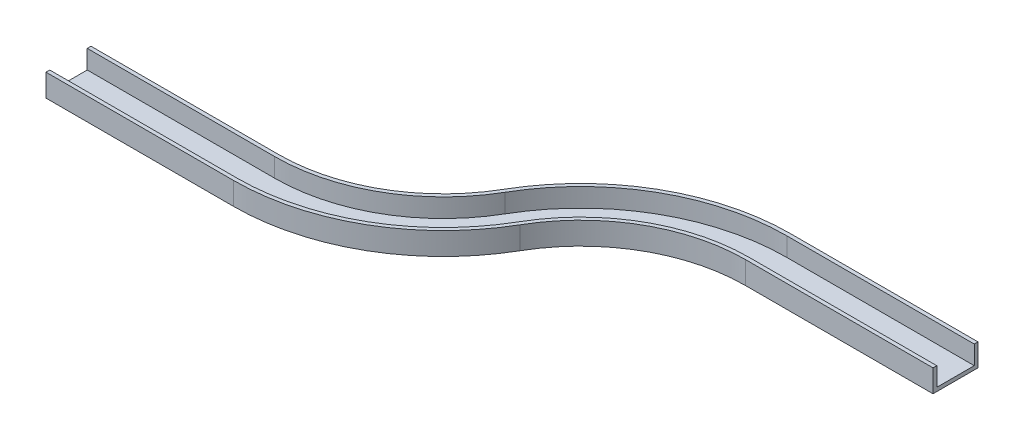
ISO-10303-21;
HEADER;
FILE_DESCRIPTION(('STEP AP214'),'2;1');
FILE_NAME('part.step','',(''),(''),'','','');
FILE_SCHEMA(('AUTOMOTIVE_DESIGN { 1 0 10303 214 1 1 1 1 }'));
ENDSEC;
DATA;
#1=APPLICATION_CONTEXT('core data for automotive mechanical design processes');
#2=APPLICATION_PROTOCOL_DEFINITION('international standard','automotive_design',2000,#1);
#3=PRODUCT_CONTEXT('',#1,'mechanical');
#4=PRODUCT('Part','Part','',(#3));
#5=PRODUCT_RELATED_PRODUCT_CATEGORY('part','',(#4));
#6=PRODUCT_DEFINITION_FORMATION('','',#4);
#7=PRODUCT_DEFINITION_CONTEXT('part definition',#1,'design');
#8=PRODUCT_DEFINITION('design','',#6,#7);
#9=PRODUCT_DEFINITION_SHAPE('','',#8);
#10=(LENGTH_UNIT() NAMED_UNIT(*) SI_UNIT(.MILLI.,.METRE.));
#11=(NAMED_UNIT(*) PLANE_ANGLE_UNIT() SI_UNIT($,.RADIAN.));
#12=(NAMED_UNIT(*) SI_UNIT($,.STERADIAN.) SOLID_ANGLE_UNIT());
#13=UNCERTAINTY_MEASURE_WITH_UNIT(LENGTH_MEASURE(1.E-05),#10,'distance_accuracy_value','');
#14=(GEOMETRIC_REPRESENTATION_CONTEXT(3) GLOBAL_UNCERTAINTY_ASSIGNED_CONTEXT((#13)) GLOBAL_UNIT_ASSIGNED_CONTEXT((#10,
#11,#12)) REPRESENTATION_CONTEXT('',''));
#15=CARTESIAN_POINT('',(0.,0.,0.));
#16=DIRECTION('',(0.,0.,1.));
#17=DIRECTION('',(1.,0.,0.));
#18=AXIS2_PLACEMENT_3D('',#15,#16,#17);
#19=CARTESIAN_POINT('',(1.11022302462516E-13,50.,49.9999999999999));
#20=DIRECTION('',(0.,0.,1.));
#21=DIRECTION('',(1.,0.,0.));
#22=AXIS2_PLACEMENT_3D('',#19,#20,#21);
#23=PLANE('',#22);
#24=DIRECTION('',(0.,1.,0.));
#25=VECTOR('',#24,1.);
#26=CARTESIAN_POINT('',(1.11022302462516E-13,50.,49.9999999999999));
#27=LINE('',#26,#25);
#28=CARTESIAN_POINT('',(1.11022302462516E-13,0.,49.9999999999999));
#29=VERTEX_POINT('',#28);
#30=CARTESIAN_POINT('',(1.11022302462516E-13,50.,49.9999999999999));
#31=VERTEX_POINT('',#30);
#32=EDGE_CURVE('E279',#29,#31,#27,.T.);
#33=ORIENTED_EDGE('',*,*,#32,.F.);
#34=DIRECTION('',(-1.,0.,0.));
#35=VECTOR('',#34,1.);
#36=CARTESIAN_POINT('',(1.11022302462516E-13,0.,49.9999999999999));
#37=LINE('',#36,#35);
#38=CARTESIAN_POINT('',(-500.,0.,50.));
#39=VERTEX_POINT('',#38);
#40=EDGE_CURVE('E40',#29,#39,#37,.T.);
#41=ORIENTED_EDGE('',*,*,#40,.T.);
#42=DIRECTION('',(0.,1.,0.));
#43=VECTOR('',#42,1.);
#44=CARTESIAN_POINT('',(-500.,50.,50.));
#45=LINE('',#44,#43);
#46=CARTESIAN_POINT('',(-500.,50.,50.));
#47=VERTEX_POINT('',#46);
#48=EDGE_CURVE('E47',#39,#47,#45,.T.);
#49=ORIENTED_EDGE('',*,*,#48,.T.);
#50=DIRECTION('',(-1.,0.,0.));
#51=VECTOR('',#50,1.);
#52=CARTESIAN_POINT('',(1.11022302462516E-13,50.,49.9999999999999));
#53=LINE('',#52,#51);
#54=EDGE_CURVE('E11',#31,#47,#53,.T.);
#55=ORIENTED_EDGE('',*,*,#54,.F.);
#56=EDGE_LOOP('',(#33,#41,#49,#55));
#57=FACE_BOUND('',#56,.T.);
#58=ADVANCED_FACE('F33',(#57),#23,.F.);
#59=CARTESIAN_POINT('',(2.77555756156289E-13,50.,-50.0000000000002));
#60=DIRECTION('',(0.,0.,-1.));
#61=DIRECTION('',(-1.,0.,0.));
#62=AXIS2_PLACEMENT_3D('',#59,#60,#61);
#63=PLANE('',#62);
#64=DIRECTION('',(0.,-1.,0.));
#65=VECTOR('',#64,1.);
#66=CARTESIAN_POINT('',(2.77555756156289E-13,50.,-50.0000000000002));
#67=LINE('',#66,#65);
#68=CARTESIAN_POINT('',(2.77555756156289E-13,50.,-50.0000000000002));
#69=VERTEX_POINT('',#68);
#70=CARTESIAN_POINT('',(2.77555756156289E-13,0.,-50.0000000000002));
#71=VERTEX_POINT('',#70);
#72=EDGE_CURVE('E276',#69,#71,#67,.T.);
#73=ORIENTED_EDGE('',*,*,#72,.F.);
#74=DIRECTION('',(-1.,0.,0.));
#75=VECTOR('',#74,1.);
#76=CARTESIAN_POINT('',(2.77555756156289E-13,50.,-50.0000000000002));
#77=LINE('',#76,#75);
#78=CARTESIAN_POINT('',(-500.,50.,-50.0000000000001));
#79=VERTEX_POINT('',#78);
#80=EDGE_CURVE('E332',#69,#79,#77,.T.);
#81=ORIENTED_EDGE('',*,*,#80,.T.);
#82=DIRECTION('',(0.,-1.,0.));
#83=VECTOR('',#82,1.);
#84=CARTESIAN_POINT('',(-500.,50.,-50.0000000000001));
#85=LINE('',#84,#83);
#86=CARTESIAN_POINT('',(-500.,0.,-50.0000000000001));
#87=VERTEX_POINT('',#86);
#88=EDGE_CURVE('E316',#79,#87,#85,.T.);
#89=ORIENTED_EDGE('',*,*,#88,.T.);
#90=DIRECTION('',(-1.,0.,0.));
#91=VECTOR('',#90,1.);
#92=CARTESIAN_POINT('',(2.77555756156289E-13,0.,-50.0000000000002));
#93=LINE('',#92,#91);
#94=EDGE_CURVE('E335',#71,#87,#93,.T.);
#95=ORIENTED_EDGE('',*,*,#94,.F.);
#96=EDGE_LOOP('',(#73,#81,#89,#95));
#97=FACE_BOUND('',#96,.T.);
#98=ADVANCED_FACE('F362',(#97),#63,.F.);
#99=CARTESIAN_POINT('',(1.66533453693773E-13,50.,-60.0000000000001));
#100=DIRECTION('',(0.,0.,1.));
#101=DIRECTION('',(1.,0.,0.));
#102=AXIS2_PLACEMENT_3D('',#99,#100,#101);
#103=PLANE('',#102);
#104=DIRECTION('',(0.,1.,0.));
#105=VECTOR('',#104,1.);
#106=CARTESIAN_POINT('',(1.66533453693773E-13,50.,-60.0000000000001));
#107=LINE('',#106,#105);
#108=CARTESIAN_POINT('',(1.66533453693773E-13,-10.,-60.0000000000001));
#109=VERTEX_POINT('',#108);
#110=CARTESIAN_POINT('',(1.66533453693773E-13,50.,-60.0000000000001));
#111=VERTEX_POINT('',#110);
#112=EDGE_CURVE('E273',#109,#111,#107,.T.);
#113=ORIENTED_EDGE('',*,*,#112,.F.);
#114=DIRECTION('',(-1.,0.,0.));
#115=VECTOR('',#114,1.);
#116=CARTESIAN_POINT('',(1.66533453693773E-13,-10.,-60.0000000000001));
#117=LINE('',#116,#115);
#118=CARTESIAN_POINT('',(-500.,-10.,-60.));
#119=VERTEX_POINT('',#118);
#120=EDGE_CURVE('E326',#109,#119,#117,.T.);
#121=ORIENTED_EDGE('',*,*,#120,.T.);
#122=DIRECTION('',(0.,1.,0.));
#123=VECTOR('',#122,1.);
#124=CARTESIAN_POINT('',(-500.,50.,-60.));
#125=LINE('',#124,#123);
#126=CARTESIAN_POINT('',(-500.,50.,-60.));
#127=VERTEX_POINT('',#126);
#128=EDGE_CURVE('E312',#119,#127,#125,.T.);
#129=ORIENTED_EDGE('',*,*,#128,.T.);
#130=DIRECTION('',(-1.,0.,0.));
#131=VECTOR('',#130,1.);
#132=CARTESIAN_POINT('',(1.66533453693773E-13,50.,-60.0000000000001));
#133=LINE('',#132,#131);
#134=EDGE_CURVE('E329',#111,#127,#133,.T.);
#135=ORIENTED_EDGE('',*,*,#134,.F.);
#136=EDGE_LOOP('',(#113,#121,#129,#135));
#137=FACE_BOUND('',#136,.T.);
#138=ADVANCED_FACE('F390',(#137),#103,.F.);
#139=CARTESIAN_POINT('',(0.,50.,59.9999999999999));
#140=DIRECTION('',(0.,0.,-1.));
#141=DIRECTION('',(-1.,0.,0.));
#142=AXIS2_PLACEMENT_3D('',#139,#140,#141);
#143=PLANE('',#142);
#144=DIRECTION('',(0.,-1.,0.));
#145=VECTOR('',#144,1.);
#146=CARTESIAN_POINT('',(0.,50.,59.9999999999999));
#147=LINE('',#146,#145);
#148=CARTESIAN_POINT('',(0.,50.,59.9999999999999));
#149=VERTEX_POINT('',#148);
#150=CARTESIAN_POINT('',(0.,-10.,59.9999999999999));
#151=VERTEX_POINT('',#150);
#152=EDGE_CURVE('E270',#149,#151,#147,.T.);
#153=ORIENTED_EDGE('',*,*,#152,.F.);
#154=DIRECTION('',(-1.,0.,0.));
#155=VECTOR('',#154,1.);
#156=CARTESIAN_POINT('',(0.,50.,59.9999999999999));
#157=LINE('',#156,#155);
#158=CARTESIAN_POINT('',(-500.,50.,60.));
#159=VERTEX_POINT('',#158);
#160=EDGE_CURVE('E320',#149,#159,#157,.T.);
#161=ORIENTED_EDGE('',*,*,#160,.T.);
#162=DIRECTION('',(0.,-1.,0.));
#163=VECTOR('',#162,1.);
#164=CARTESIAN_POINT('',(-500.,50.,60.));
#165=LINE('',#164,#163);
#166=CARTESIAN_POINT('',(-500.,-10.,60.));
#167=VERTEX_POINT('',#166);
#168=EDGE_CURVE('E308',#159,#167,#165,.T.);
#169=ORIENTED_EDGE('',*,*,#168,.T.);
#170=DIRECTION('',(-1.,0.,0.));
#171=VECTOR('',#170,1.);
#172=CARTESIAN_POINT('',(0.,-10.,59.9999999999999));
#173=LINE('',#172,#171);
#174=EDGE_CURVE('E323',#151,#167,#173,.T.);
#175=ORIENTED_EDGE('',*,*,#174,.F.);
#176=EDGE_LOOP('',(#153,#161,#169,#175));
#177=FACE_BOUND('',#176,.T.);
#178=ADVANCED_FACE('F372',(#177),#143,.F.);
#179=CARTESIAN_POINT('',(0.,0.,-500.));
#180=DIRECTION('',(0.,-1.,0.));
#181=DIRECTION('',(0.,0.,-1.));
#182=AXIS2_PLACEMENT_3D('',#179,#180,#181);
#183=CYLINDRICAL_SURFACE('',#182,550.);
#184=DIRECTION('',(0.,1.,0.));
#185=VECTOR('',#184,1.);
#186=CARTESIAN_POINT('',(476.313972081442,50.,-225.000000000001));
#187=LINE('',#186,#185);
#188=CARTESIAN_POINT('',(476.313972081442,0.,-225.000000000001));
#189=VERTEX_POINT('',#188);
#190=CARTESIAN_POINT('',(476.313972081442,50.,-225.000000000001));
#191=VERTEX_POINT('',#190);
#192=EDGE_CURVE('E245',#189,#191,#187,.T.);
#193=ORIENTED_EDGE('',*,*,#192,.F.);
#194=CARTESIAN_POINT('',(0.,0.,-500.));
#195=DIRECTION('',(0.,-1.,0.));
#196=DIRECTION('',(0.,0.,-1.));
#197=AXIS2_PLACEMENT_3D('',#194,#195,#196);
#198=CIRCLE('',#197,550.);
#199=EDGE_CURVE('E300',#189,#29,#198,.T.);
#200=ORIENTED_EDGE('',*,*,#199,.T.);
#201=ORIENTED_EDGE('',*,*,#32,.T.);
#202=CARTESIAN_POINT('',(0.,50.,-500.));
#203=DIRECTION('',(0.,-1.,0.));
#204=DIRECTION('',(0.,0.,-1.));
#205=AXIS2_PLACEMENT_3D('',#202,#203,#204);
#206=CIRCLE('',#205,550.);
#207=EDGE_CURVE('E303',#191,#31,#206,.T.);
#208=ORIENTED_EDGE('',*,*,#207,.F.);
#209=EDGE_LOOP('',(#193,#200,#201,#208));
#210=FACE_BOUND('',#209,.T.);
#211=ADVANCED_FACE('F342',(#210),#183,.F.);
#212=CARTESIAN_POINT('',(0.,0.,-500.));
#213=DIRECTION('',(0.,-1.,0.));
#214=DIRECTION('',(0.,0.,-1.));
#215=AXIS2_PLACEMENT_3D('',#212,#213,#214);
#216=CYLINDRICAL_SURFACE('',#215,450.);
#217=DIRECTION('',(0.,-1.,0.));
#218=VECTOR('',#217,1.);
#219=CARTESIAN_POINT('',(389.711431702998,50.,-275.000000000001));
#220=LINE('',#219,#218);
#221=CARTESIAN_POINT('',(389.711431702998,50.,-275.000000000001));
#222=VERTEX_POINT('',#221);
#223=CARTESIAN_POINT('',(389.711431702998,0.,-275.000000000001));
#224=VERTEX_POINT('',#223);
#225=EDGE_CURVE('E242',#222,#224,#220,.T.);
#226=ORIENTED_EDGE('',*,*,#225,.F.);
#227=CARTESIAN_POINT('',(0.,50.,-500.));
#228=DIRECTION('',(0.,-1.,0.));
#229=DIRECTION('',(0.,0.,-1.));
#230=AXIS2_PLACEMENT_3D('',#227,#228,#229);
#231=CIRCLE('',#230,450.);
#232=EDGE_CURVE('E294',#222,#69,#231,.T.);
#233=ORIENTED_EDGE('',*,*,#232,.T.);
#234=ORIENTED_EDGE('',*,*,#72,.T.);
#235=CARTESIAN_POINT('',(0.,0.,-500.));
#236=DIRECTION('',(0.,-1.,0.));
#237=DIRECTION('',(0.,0.,-1.));
#238=AXIS2_PLACEMENT_3D('',#235,#236,#237);
#239=CIRCLE('',#238,450.);
#240=EDGE_CURVE('E297',#224,#71,#239,.T.);
#241=ORIENTED_EDGE('',*,*,#240,.F.);
#242=EDGE_LOOP('',(#226,#233,#234,#241));
#243=FACE_BOUND('',#242,.T.);
#244=ADVANCED_FACE('F359',(#243),#216,.T.);
#245=CARTESIAN_POINT('',(0.,0.,-500.));
#246=DIRECTION('',(0.,-1.,0.));
#247=DIRECTION('',(0.,0.,-1.));
#248=AXIS2_PLACEMENT_3D('',#245,#246,#247);
#249=CYLINDRICAL_SURFACE('',#248,440.);
#250=DIRECTION('',(0.,1.,0.));
#251=VECTOR('',#250,1.);
#252=CARTESIAN_POINT('',(381.051177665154,50.,-280.000000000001));
#253=LINE('',#252,#251);
#254=CARTESIAN_POINT('',(381.051177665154,-10.,-280.000000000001));
#255=VERTEX_POINT('',#254);
#256=CARTESIAN_POINT('',(381.051177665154,50.,-280.000000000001));
#257=VERTEX_POINT('',#256);
#258=EDGE_CURVE('E239',#255,#257,#253,.T.);
#259=ORIENTED_EDGE('',*,*,#258,.F.);
#260=CARTESIAN_POINT('',(0.,-10.,-500.));
#261=DIRECTION('',(0.,-1.,0.));
#262=DIRECTION('',(0.,0.,-1.));
#263=AXIS2_PLACEMENT_3D('',#260,#261,#262);
#264=CIRCLE('',#263,440.);
#265=EDGE_CURVE('E288',#255,#109,#264,.T.);
#266=ORIENTED_EDGE('',*,*,#265,.T.);
#267=ORIENTED_EDGE('',*,*,#112,.T.);
#268=CARTESIAN_POINT('',(0.,50.,-500.));
#269=DIRECTION('',(0.,-1.,0.));
#270=DIRECTION('',(0.,0.,-1.));
#271=AXIS2_PLACEMENT_3D('',#268,#269,#270);
#272=CIRCLE('',#271,440.);
#273=EDGE_CURVE('E291',#257,#111,#272,.T.);
#274=ORIENTED_EDGE('',*,*,#273,.F.);
#275=EDGE_LOOP('',(#259,#266,#267,#274));
#276=FACE_BOUND('',#275,.T.);
#277=ADVANCED_FACE('F393',(#276),#249,.F.);
#278=CARTESIAN_POINT('',(0.,0.,-500.));
#279=DIRECTION('',(0.,-1.,0.));
#280=DIRECTION('',(0.,0.,-1.));
#281=AXIS2_PLACEMENT_3D('',#278,#279,#280);
#282=CYLINDRICAL_SURFACE('',#281,560.);
#283=DIRECTION('',(0.,-1.,0.));
#284=VECTOR('',#283,1.);
#285=CARTESIAN_POINT('',(484.974226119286,50.,-220.000000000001));
#286=LINE('',#285,#284);
#287=CARTESIAN_POINT('',(484.974226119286,50.,-220.000000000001));
#288=VERTEX_POINT('',#287);
#289=CARTESIAN_POINT('',(484.974226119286,-10.,-220.000000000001));
#290=VERTEX_POINT('',#289);
#291=EDGE_CURVE('E225',#288,#290,#286,.T.);
#292=ORIENTED_EDGE('',*,*,#291,.F.);
#293=CARTESIAN_POINT('',(0.,50.,-500.));
#294=DIRECTION('',(0.,-1.,0.));
#295=DIRECTION('',(0.,0.,-1.));
#296=AXIS2_PLACEMENT_3D('',#293,#294,#295);
#297=CIRCLE('',#296,560.);
#298=EDGE_CURVE('E282',#288,#149,#297,.T.);
#299=ORIENTED_EDGE('',*,*,#298,.T.);
#300=ORIENTED_EDGE('',*,*,#152,.T.);
#301=CARTESIAN_POINT('',(0.,-10.,-500.));
#302=DIRECTION('',(0.,-1.,0.));
#303=DIRECTION('',(0.,0.,-1.));
#304=AXIS2_PLACEMENT_3D('',#301,#302,#303);
#305=CIRCLE('',#304,560.);
#306=EDGE_CURVE('E285',#290,#151,#305,.T.);
#307=ORIENTED_EDGE('',*,*,#306,.F.);
#308=EDGE_LOOP('',(#292,#299,#300,#307));
#309=FACE_BOUND('',#308,.T.);
#310=ADVANCED_FACE('F374',(#309),#282,.T.);
#311=CARTESIAN_POINT('',(866.02540378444,0.,-2.42683658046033E-12));
#312=DIRECTION('',(0.,1.,0.));
#313=DIRECTION('',(0.,0.,1.));
#314=AXIS2_PLACEMENT_3D('',#311,#312,#313);
#315=CYLINDRICAL_SURFACE('',#314,450.);
#316=DIRECTION('',(0.,1.,0.));
#317=VECTOR('',#316,1.);
#318=CARTESIAN_POINT('',(866.02540378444,50.,-450.000000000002));
#319=LINE('',#318,#317);
#320=CARTESIAN_POINT('',(866.02540378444,0.,-450.000000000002));
#321=VERTEX_POINT('',#320);
#322=CARTESIAN_POINT('',(866.02540378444,50.,-450.000000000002));
#323=VERTEX_POINT('',#322);
#324=EDGE_CURVE('E183',#321,#323,#319,.T.);
#325=ORIENTED_EDGE('',*,*,#324,.F.);
#326=CARTESIAN_POINT('',(866.02540378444,0.,-2.42683658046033E-12));
#327=DIRECTION('',(0.,1.,0.));
#328=DIRECTION('',(0.,0.,1.));
#329=AXIS2_PLACEMENT_3D('',#326,#327,#328);
#330=CIRCLE('',#329,450.);
#331=EDGE_CURVE('E264',#321,#189,#330,.T.);
#332=ORIENTED_EDGE('',*,*,#331,.T.);
#333=ORIENTED_EDGE('',*,*,#192,.T.);
#334=CARTESIAN_POINT('',(866.02540378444,50.,-2.42683658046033E-12));
#335=DIRECTION('',(0.,1.,0.));
#336=DIRECTION('',(0.,0.,1.));
#337=AXIS2_PLACEMENT_3D('',#334,#335,#336);
#338=CIRCLE('',#337,450.);
#339=EDGE_CURVE('E267',#323,#191,#338,.T.);
#340=ORIENTED_EDGE('',*,*,#339,.F.);
#341=EDGE_LOOP('',(#325,#332,#333,#340));
#342=FACE_BOUND('',#341,.T.);
#343=ADVANCED_FACE('F344',(#342),#315,.T.);
#344=CARTESIAN_POINT('',(866.02540378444,0.,-2.42683658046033E-12));
#345=DIRECTION('',(0.,1.,0.));
#346=DIRECTION('',(0.,0.,1.));
#347=AXIS2_PLACEMENT_3D('',#344,#345,#346);
#348=CYLINDRICAL_SURFACE('',#347,550.);
#349=DIRECTION('',(0.,-1.,0.));
#350=VECTOR('',#349,1.);
#351=CARTESIAN_POINT('',(866.02540378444,50.,-550.000000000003));
#352=LINE('',#351,#350);
#353=CARTESIAN_POINT('',(866.02540378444,50.,-550.000000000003));
#354=VERTEX_POINT('',#353);
#355=CARTESIAN_POINT('',(866.02540378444,0.,-550.000000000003));
#356=VERTEX_POINT('',#355);
#357=EDGE_CURVE('E218',#354,#356,#352,.T.);
#358=ORIENTED_EDGE('',*,*,#357,.F.);
#359=CARTESIAN_POINT('',(866.02540378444,50.,-2.42683658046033E-12));
#360=DIRECTION('',(0.,1.,0.));
#361=DIRECTION('',(0.,0.,1.));
#362=AXIS2_PLACEMENT_3D('',#359,#360,#361);
#363=CIRCLE('',#362,550.);
#364=EDGE_CURVE('E258',#354,#222,#363,.T.);
#365=ORIENTED_EDGE('',*,*,#364,.T.);
#366=ORIENTED_EDGE('',*,*,#225,.T.);
#367=CARTESIAN_POINT('',(866.02540378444,0.,-2.42683658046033E-12));
#368=DIRECTION('',(0.,1.,0.));
#369=DIRECTION('',(0.,0.,1.));
#370=AXIS2_PLACEMENT_3D('',#367,#368,#369);
#371=CIRCLE('',#370,550.);
#372=EDGE_CURVE('E261',#356,#224,#371,.T.);
#373=ORIENTED_EDGE('',*,*,#372,.F.);
#374=EDGE_LOOP('',(#358,#365,#366,#373));
#375=FACE_BOUND('',#374,.T.);
#376=ADVANCED_FACE('F356',(#375),#348,.F.);
#377=CARTESIAN_POINT('',(866.02540378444,0.,-2.42683658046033E-12));
#378=DIRECTION('',(0.,1.,0.));
#379=DIRECTION('',(0.,0.,1.));
#380=AXIS2_PLACEMENT_3D('',#377,#378,#379);
#381=CYLINDRICAL_SURFACE('',#380,560.);
#382=DIRECTION('',(0.,1.,0.));
#383=VECTOR('',#382,1.);
#384=CARTESIAN_POINT('',(866.02540378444,50.,-560.000000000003));
#385=LINE('',#384,#383);
#386=CARTESIAN_POINT('',(866.02540378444,-10.,-560.000000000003));
#387=VERTEX_POINT('',#386);
#388=CARTESIAN_POINT('',(866.02540378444,50.,-560.000000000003));
#389=VERTEX_POINT('',#388);
#390=EDGE_CURVE('E215',#387,#389,#385,.T.);
#391=ORIENTED_EDGE('',*,*,#390,.F.);
#392=CARTESIAN_POINT('',(866.02540378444,-10.,-2.42683658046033E-12));
#393=DIRECTION('',(0.,1.,0.));
#394=DIRECTION('',(0.,0.,1.));
#395=AXIS2_PLACEMENT_3D('',#392,#393,#394);
#396=CIRCLE('',#395,560.);
#397=EDGE_CURVE('E252',#387,#255,#396,.T.);
#398=ORIENTED_EDGE('',*,*,#397,.T.);
#399=ORIENTED_EDGE('',*,*,#258,.T.);
#400=CARTESIAN_POINT('',(866.02540378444,50.,-2.42683658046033E-12));
#401=DIRECTION('',(0.,1.,0.));
#402=DIRECTION('',(0.,0.,1.));
#403=AXIS2_PLACEMENT_3D('',#400,#401,#402);
#404=CIRCLE('',#403,560.);
#405=EDGE_CURVE('E255',#389,#257,#404,.T.);
#406=ORIENTED_EDGE('',*,*,#405,.F.);
#407=EDGE_LOOP('',(#391,#398,#399,#406));
#408=FACE_BOUND('',#407,.T.);
#409=ADVANCED_FACE('F395',(#408),#381,.T.);
#410=CARTESIAN_POINT('',(866.02540378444,0.,-2.42683658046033E-12));
#411=DIRECTION('',(0.,1.,0.));
#412=DIRECTION('',(0.,0.,1.));
#413=AXIS2_PLACEMENT_3D('',#410,#411,#412);
#414=CYLINDRICAL_SURFACE('',#413,440.);
#415=DIRECTION('',(0.,-1.,0.));
#416=VECTOR('',#415,1.);
#417=CARTESIAN_POINT('',(866.02540378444,50.,-440.000000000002));
#418=LINE('',#417,#416);
#419=CARTESIAN_POINT('',(866.02540378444,50.,-440.000000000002));
#420=VERTEX_POINT('',#419);
#421=CARTESIAN_POINT('',(866.02540378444,-10.,-440.000000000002));
#422=VERTEX_POINT('',#421);
#423=EDGE_CURVE('E213',#420,#422,#418,.T.);
#424=ORIENTED_EDGE('',*,*,#423,.F.);
#425=CARTESIAN_POINT('',(866.02540378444,50.,-2.42683658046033E-12));
#426=DIRECTION('',(0.,1.,0.));
#427=DIRECTION('',(0.,0.,1.));
#428=AXIS2_PLACEMENT_3D('',#425,#426,#427);
#429=CIRCLE('',#428,440.);
#430=EDGE_CURVE('E178',#420,#288,#429,.T.);
#431=ORIENTED_EDGE('',*,*,#430,.T.);
#432=ORIENTED_EDGE('',*,*,#291,.T.);
#433=CARTESIAN_POINT('',(866.02540378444,-10.,-2.42683658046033E-12));
#434=DIRECTION('',(0.,1.,0.));
#435=DIRECTION('',(0.,0.,1.));
#436=AXIS2_PLACEMENT_3D('',#433,#434,#435);
#437=CIRCLE('',#436,440.);
#438=EDGE_CURVE('E249',#422,#290,#437,.T.);
#439=ORIENTED_EDGE('',*,*,#438,.F.);
#440=EDGE_LOOP('',(#424,#431,#432,#439));
#441=FACE_BOUND('',#440,.T.);
#442=ADVANCED_FACE('F376',(#441),#414,.F.);
#443=CARTESIAN_POINT('',(866.02540378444,50.,-440.000000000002));
#444=DIRECTION('',(0.,1.,0.));
#445=DIRECTION('',(0.,0.,1.));
#446=AXIS2_PLACEMENT_3D('',#443,#444,#445);
#447=PLANE('',#446);
#448=DIRECTION('',(0.,0.,1.));
#449=VECTOR('',#448,1.);
#450=CARTESIAN_POINT('',(1366.02540378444,50.,-440.000000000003));
#451=LINE('',#450,#449);
#452=CARTESIAN_POINT('',(1366.02540378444,50.,-450.000000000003));
#453=VERTEX_POINT('',#452);
#454=CARTESIAN_POINT('',(1366.02540378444,50.,-440.000000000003));
#455=VERTEX_POINT('',#454);
#456=EDGE_CURVE('E175',#453,#455,#451,.T.);
#457=ORIENTED_EDGE('',*,*,#456,.F.);
#458=DIRECTION('',(1.,0.,0.));
#459=VECTOR('',#458,1.);
#460=CARTESIAN_POINT('',(866.02540378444,50.,-450.000000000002));
#461=LINE('',#460,#459);
#462=EDGE_CURVE('E223',#323,#453,#461,.T.);
#463=ORIENTED_EDGE('',*,*,#462,.F.);
#464=ORIENTED_EDGE('',*,*,#339,.T.);
#465=ORIENTED_EDGE('',*,*,#207,.T.);
#466=ORIENTED_EDGE('',*,*,#54,.T.);
#467=DIRECTION('',(0.,0.,1.));
#468=VECTOR('',#467,1.);
#469=CARTESIAN_POINT('',(-500.,50.,60.));
#470=LINE('',#469,#468);
#471=EDGE_CURVE('E306',#47,#159,#470,.T.);
#472=ORIENTED_EDGE('',*,*,#471,.T.);
#473=ORIENTED_EDGE('',*,*,#160,.F.);
#474=ORIENTED_EDGE('',*,*,#298,.F.);
#475=ORIENTED_EDGE('',*,*,#430,.F.);
#476=DIRECTION('',(1.,0.,0.));
#477=VECTOR('',#476,1.);
#478=CARTESIAN_POINT('',(866.02540378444,50.,-440.000000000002));
#479=LINE('',#478,#477);
#480=EDGE_CURVE('E170',#420,#455,#479,.T.);
#481=ORIENTED_EDGE('',*,*,#480,.T.);
#482=EDGE_LOOP('',(#457,#463,#464,#465,#466,#472,#473,#474,#475,#481));
#483=FACE_BOUND('',#482,.T.);
#484=ADVANCED_FACE('F172',(#483),#447,.T.);
#485=CARTESIAN_POINT('',(866.02540378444,50.,-450.000000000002));
#486=DIRECTION('',(0.,0.,-1.));
#487=DIRECTION('',(-1.,0.,0.));
#488=AXIS2_PLACEMENT_3D('',#485,#486,#487);
#489=PLANE('',#488);
#490=DIRECTION('',(0.,1.,0.));
#491=VECTOR('',#490,1.);
#492=CARTESIAN_POINT('',(1366.02540378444,50.,-450.000000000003));
#493=LINE('',#492,#491);
#494=CARTESIAN_POINT('',(1366.02540378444,0.,-450.000000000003));
#495=VERTEX_POINT('',#494);
#496=EDGE_CURVE('E197',#495,#453,#493,.T.);
#497=ORIENTED_EDGE('',*,*,#496,.F.);
#498=DIRECTION('',(1.,0.,0.));
#499=VECTOR('',#498,1.);
#500=CARTESIAN_POINT('',(866.02540378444,0.,-450.000000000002));
#501=LINE('',#500,#499);
#502=EDGE_CURVE('E226',#321,#495,#501,.T.);
#503=ORIENTED_EDGE('',*,*,#502,.F.);
#504=ORIENTED_EDGE('',*,*,#324,.T.);
#505=ORIENTED_EDGE('',*,*,#462,.T.);
#506=EDGE_LOOP('',(#497,#503,#504,#505));
#507=FACE_BOUND('',#506,.T.);
#508=ADVANCED_FACE('F347',(#507),#489,.T.);
#509=CARTESIAN_POINT('',(866.02540378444,0.,-450.000000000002));
#510=DIRECTION('',(0.,1.,0.));
#511=DIRECTION('',(0.,0.,1.));
#512=AXIS2_PLACEMENT_3D('',#509,#510,#511);
#513=PLANE('',#512);
#514=DIRECTION('',(0.,0.,1.));
#515=VECTOR('',#514,1.);
#516=CARTESIAN_POINT('',(1366.02540378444,0.,-450.000000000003));
#517=LINE('',#516,#515);
#518=CARTESIAN_POINT('',(1366.02540378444,0.,-550.000000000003));
#519=VERTEX_POINT('',#518);
#520=EDGE_CURVE('E210',#519,#495,#517,.T.);
#521=ORIENTED_EDGE('',*,*,#520,.F.);
#522=DIRECTION('',(1.,0.,0.));
#523=VECTOR('',#522,1.);
#524=CARTESIAN_POINT('',(866.02540378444,0.,-550.000000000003));
#525=LINE('',#524,#523);
#526=EDGE_CURVE('E228',#356,#519,#525,.T.);
#527=ORIENTED_EDGE('',*,*,#526,.F.);
#528=ORIENTED_EDGE('',*,*,#372,.T.);
#529=ORIENTED_EDGE('',*,*,#240,.T.);
#530=ORIENTED_EDGE('',*,*,#94,.T.);
#531=DIRECTION('',(0.,0.,1.));
#532=VECTOR('',#531,1.);
#533=CARTESIAN_POINT('',(-500.,0.,50.));
#534=LINE('',#533,#532);
#535=EDGE_CURVE('E55',#87,#39,#534,.T.);
#536=ORIENTED_EDGE('',*,*,#535,.T.);
#537=ORIENTED_EDGE('',*,*,#40,.F.);
#538=ORIENTED_EDGE('',*,*,#199,.F.);
#539=ORIENTED_EDGE('',*,*,#331,.F.);
#540=ORIENTED_EDGE('',*,*,#502,.T.);
#541=EDGE_LOOP('',(#521,#527,#528,#529,#530,#536,#537,#538,#539,#540));
#542=FACE_BOUND('',#541,.T.);
#543=ADVANCED_FACE('F338',(#542),#513,.T.);
#544=CARTESIAN_POINT('',(866.02540378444,50.,-550.000000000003));
#545=DIRECTION('',(0.,0.,1.));
#546=DIRECTION('',(1.,0.,0.));
#547=AXIS2_PLACEMENT_3D('',#544,#545,#546);
#548=PLANE('',#547);
#549=DIRECTION('',(0.,-1.,0.));
#550=VECTOR('',#549,1.);
#551=CARTESIAN_POINT('',(1366.02540378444,50.,-550.000000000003));
#552=LINE('',#551,#550);
#553=CARTESIAN_POINT('',(1366.02540378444,50.,-550.000000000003));
#554=VERTEX_POINT('',#553);
#555=EDGE_CURVE('E207',#554,#519,#552,.T.);
#556=ORIENTED_EDGE('',*,*,#555,.F.);
#557=DIRECTION('',(1.,0.,0.));
#558=VECTOR('',#557,1.);
#559=CARTESIAN_POINT('',(866.02540378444,50.,-550.000000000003));
#560=LINE('',#559,#558);
#561=EDGE_CURVE('E230',#354,#554,#560,.T.);
#562=ORIENTED_EDGE('',*,*,#561,.F.);
#563=ORIENTED_EDGE('',*,*,#357,.T.);
#564=ORIENTED_EDGE('',*,*,#526,.T.);
#565=EDGE_LOOP('',(#556,#562,#563,#564));
#566=FACE_BOUND('',#565,.T.);
#567=ADVANCED_FACE('F353',(#566),#548,.T.);
#568=CARTESIAN_POINT('',(866.02540378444,50.,-550.000000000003));
#569=DIRECTION('',(0.,1.,0.));
#570=DIRECTION('',(0.,0.,1.));
#571=AXIS2_PLACEMENT_3D('',#568,#569,#570);
#572=PLANE('',#571);
#573=DIRECTION('',(0.,0.,1.));
#574=VECTOR('',#573,1.);
#575=CARTESIAN_POINT('',(1366.02540378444,50.,-550.000000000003));
#576=LINE('',#575,#574);
#577=CARTESIAN_POINT('',(1366.02540378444,50.,-560.000000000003));
#578=VERTEX_POINT('',#577);
#579=EDGE_CURVE('E204',#578,#554,#576,.T.);
#580=ORIENTED_EDGE('',*,*,#579,.F.);
#581=DIRECTION('',(1.,0.,0.));
#582=VECTOR('',#581,1.);
#583=CARTESIAN_POINT('',(866.02540378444,50.,-560.000000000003));
#584=LINE('',#583,#582);
#585=EDGE_CURVE('E232',#389,#578,#584,.T.);
#586=ORIENTED_EDGE('',*,*,#585,.F.);
#587=ORIENTED_EDGE('',*,*,#405,.T.);
#588=ORIENTED_EDGE('',*,*,#273,.T.);
#589=ORIENTED_EDGE('',*,*,#134,.T.);
#590=DIRECTION('',(0.,0.,1.));
#591=VECTOR('',#590,1.);
#592=CARTESIAN_POINT('',(-500.,50.,-50.0000000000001));
#593=LINE('',#592,#591);
#594=EDGE_CURVE('E314',#127,#79,#593,.T.);
#595=ORIENTED_EDGE('',*,*,#594,.T.);
#596=ORIENTED_EDGE('',*,*,#80,.F.);
#597=ORIENTED_EDGE('',*,*,#232,.F.);
#598=ORIENTED_EDGE('',*,*,#364,.F.);
#599=ORIENTED_EDGE('',*,*,#561,.T.);
#600=EDGE_LOOP('',(#580,#586,#587,#588,#589,#595,#596,#597,#598,#599));
#601=FACE_BOUND('',#600,.T.);
#602=ADVANCED_FACE('F386',(#601),#572,.T.);
#603=CARTESIAN_POINT('',(866.02540378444,50.,-560.000000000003));
#604=DIRECTION('',(0.,0.,-1.));
#605=DIRECTION('',(-1.,0.,0.));
#606=AXIS2_PLACEMENT_3D('',#603,#604,#605);
#607=PLANE('',#606);
#608=DIRECTION('',(0.,1.,0.));
#609=VECTOR('',#608,1.);
#610=CARTESIAN_POINT('',(1366.02540378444,50.,-560.000000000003));
#611=LINE('',#610,#609);
#612=CARTESIAN_POINT('',(1366.02540378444,-10.,-560.000000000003));
#613=VERTEX_POINT('',#612);
#614=EDGE_CURVE('E201',#613,#578,#611,.T.);
#615=ORIENTED_EDGE('',*,*,#614,.F.);
#616=DIRECTION('',(1.,0.,0.));
#617=VECTOR('',#616,1.);
#618=CARTESIAN_POINT('',(866.02540378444,-10.,-560.000000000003));
#619=LINE('',#618,#617);
#620=EDGE_CURVE('E234',#387,#613,#619,.T.);
#621=ORIENTED_EDGE('',*,*,#620,.F.);
#622=ORIENTED_EDGE('',*,*,#390,.T.);
#623=ORIENTED_EDGE('',*,*,#585,.T.);
#624=EDGE_LOOP('',(#615,#621,#622,#623));
#625=FACE_BOUND('',#624,.T.);
#626=ADVANCED_FACE('F382',(#625),#607,.T.);
#627=CARTESIAN_POINT('',(866.02540378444,-10.,-440.000000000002));
#628=DIRECTION('',(0.,-1.,0.));
#629=DIRECTION('',(0.,0.,-1.));
#630=AXIS2_PLACEMENT_3D('',#627,#628,#629);
#631=PLANE('',#630);
#632=DIRECTION('',(0.,0.,-1.));
#633=VECTOR('',#632,1.);
#634=CARTESIAN_POINT('',(1366.02540378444,-10.,-440.000000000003));
#635=LINE('',#634,#633);
#636=CARTESIAN_POINT('',(1366.02540378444,-10.,-440.000000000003));
#637=VERTEX_POINT('',#636);
#638=EDGE_CURVE('E192',#637,#613,#635,.T.);
#639=ORIENTED_EDGE('',*,*,#638,.F.);
#640=DIRECTION('',(1.,0.,0.));
#641=VECTOR('',#640,1.);
#642=CARTESIAN_POINT('',(866.02540378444,-10.,-440.000000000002));
#643=LINE('',#642,#641);
#644=EDGE_CURVE('E182',#422,#637,#643,.T.);
#645=ORIENTED_EDGE('',*,*,#644,.F.);
#646=ORIENTED_EDGE('',*,*,#438,.T.);
#647=ORIENTED_EDGE('',*,*,#306,.T.);
#648=ORIENTED_EDGE('',*,*,#174,.T.);
#649=DIRECTION('',(0.,0.,-1.));
#650=VECTOR('',#649,1.);
#651=CARTESIAN_POINT('',(-500.,-10.,60.));
#652=LINE('',#651,#650);
#653=EDGE_CURVE('E310',#167,#119,#652,.T.);
#654=ORIENTED_EDGE('',*,*,#653,.T.);
#655=ORIENTED_EDGE('',*,*,#120,.F.);
#656=ORIENTED_EDGE('',*,*,#265,.F.);
#657=ORIENTED_EDGE('',*,*,#397,.F.);
#658=ORIENTED_EDGE('',*,*,#620,.T.);
#659=EDGE_LOOP('',(#639,#645,#646,#647,#648,#654,#655,#656,#657,#658));
#660=FACE_BOUND('',#659,.T.);
#661=ADVANCED_FACE('F378',(#660),#631,.T.);
#662=CARTESIAN_POINT('',(866.02540378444,50.,-440.000000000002));
#663=DIRECTION('',(0.,0.,1.));
#664=DIRECTION('',(1.,0.,0.));
#665=AXIS2_PLACEMENT_3D('',#662,#663,#664);
#666=PLANE('',#665);
#667=DIRECTION('',(0.,-1.,0.));
#668=VECTOR('',#667,1.);
#669=CARTESIAN_POINT('',(1366.02540378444,50.,-440.000000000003));
#670=LINE('',#669,#668);
#671=EDGE_CURVE('E186',#455,#637,#670,.T.);
#672=ORIENTED_EDGE('',*,*,#671,.F.);
#673=ORIENTED_EDGE('',*,*,#480,.F.);
#674=ORIENTED_EDGE('',*,*,#423,.T.);
#675=ORIENTED_EDGE('',*,*,#644,.T.);
#676=EDGE_LOOP('',(#672,#673,#674,#675));
#677=FACE_BOUND('',#676,.T.);
#678=ADVANCED_FACE('F187',(#677),#666,.T.);
#679=CARTESIAN_POINT('',(-500.,50.,50.));
#680=DIRECTION('',(-1.,0.,0.));
#681=DIRECTION('',(0.,0.,1.));
#682=AXIS2_PLACEMENT_3D('',#679,#680,#681);
#683=PLANE('',#682);
#684=ORIENTED_EDGE('',*,*,#471,.F.);
#685=ORIENTED_EDGE('',*,*,#48,.F.);
#686=ORIENTED_EDGE('',*,*,#535,.F.);
#687=ORIENTED_EDGE('',*,*,#88,.F.);
#688=ORIENTED_EDGE('',*,*,#594,.F.);
#689=ORIENTED_EDGE('',*,*,#128,.F.);
#690=ORIENTED_EDGE('',*,*,#653,.F.);
#691=ORIENTED_EDGE('',*,*,#168,.F.);
#692=EDGE_LOOP('',(#684,#685,#686,#687,#688,#689,#690,#691));
#693=FACE_BOUND('',#692,.T.);
#694=ADVANCED_FACE('F366',(#693),#683,.T.);
#695=CARTESIAN_POINT('',(1366.02540378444,50.,-450.000000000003));
#696=DIRECTION('',(-1.,0.,0.));
#697=DIRECTION('',(0.,0.,1.));
#698=AXIS2_PLACEMENT_3D('',#695,#696,#697);
#699=PLANE('',#698);
#700=ORIENTED_EDGE('',*,*,#456,.T.);
#701=ORIENTED_EDGE('',*,*,#671,.T.);
#702=ORIENTED_EDGE('',*,*,#638,.T.);
#703=ORIENTED_EDGE('',*,*,#614,.T.);
#704=ORIENTED_EDGE('',*,*,#579,.T.);
#705=ORIENTED_EDGE('',*,*,#555,.T.);
#706=ORIENTED_EDGE('',*,*,#520,.T.);
#707=ORIENTED_EDGE('',*,*,#496,.T.);
#708=EDGE_LOOP('',(#700,#701,#702,#703,#704,#705,#706,#707));
#709=FACE_BOUND('',#708,.T.);
#710=ADVANCED_FACE('F194',(#709),#699,.F.);
#711=CLOSED_SHELL('',(#58,#98,#138,#178,#211,#244,#277,#310,#343,#376,#409,#442,#484,#508,#543,
#567,#602,#626,#661,#678,#694,#710));
#712=MANIFOLD_SOLID_BREP('B2',#711);
#713=ADVANCED_BREP_SHAPE_REPRESENTATION('',(#18,#712),#14);
#714=SHAPE_DEFINITION_REPRESENTATION(#9,#713);
ENDSEC;
END-ISO-10303-21;
